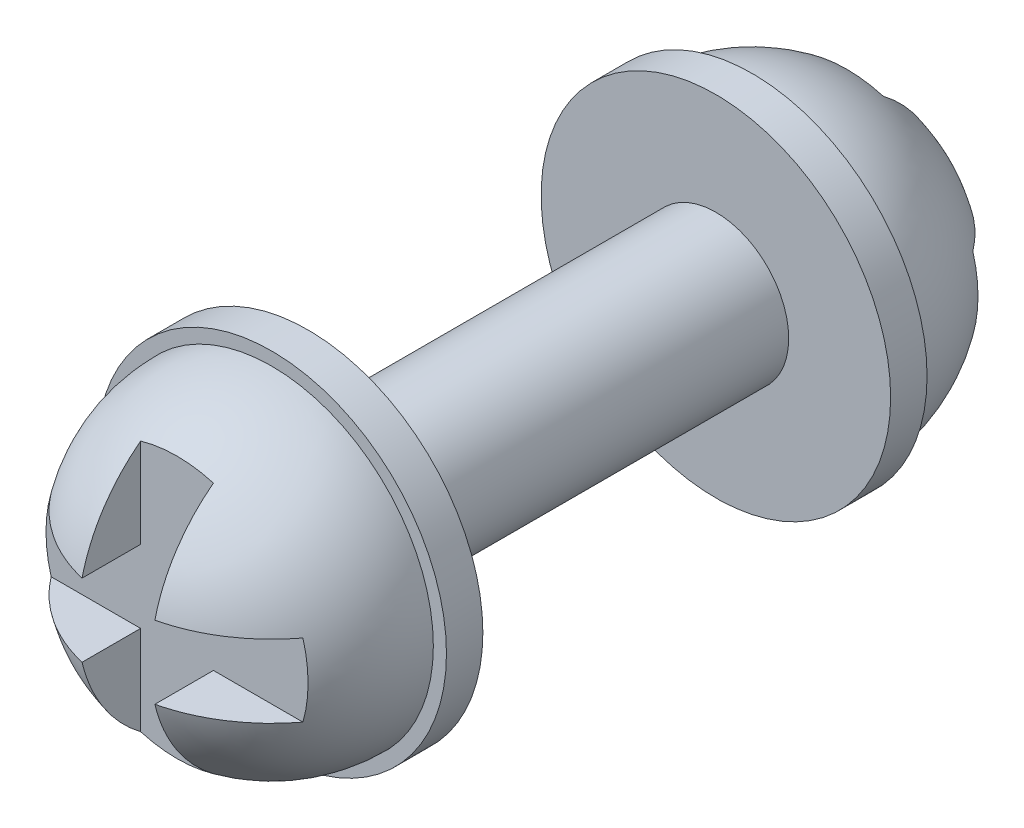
ISO-10303-21;
HEADER;
FILE_DESCRIPTION(('STEP AP214'),'2;1');
FILE_NAME('part.step','',(''),(''),'','','');
FILE_SCHEMA(('AUTOMOTIVE_DESIGN { 1 0 10303 214 1 1 1 1 }'));
ENDSEC;
DATA;
#1=APPLICATION_CONTEXT('core data for automotive mechanical design processes');
#2=APPLICATION_PROTOCOL_DEFINITION('international standard','automotive_design',2000,#1);
#3=PRODUCT_CONTEXT('',#1,'mechanical');
#4=PRODUCT('Part','Part','',(#3));
#5=PRODUCT_RELATED_PRODUCT_CATEGORY('part','',(#4));
#6=PRODUCT_DEFINITION_FORMATION('','',#4);
#7=PRODUCT_DEFINITION_CONTEXT('part definition',#1,'design');
#8=PRODUCT_DEFINITION('design','',#6,#7);
#9=PRODUCT_DEFINITION_SHAPE('','',#8);
#10=(LENGTH_UNIT() NAMED_UNIT(*) SI_UNIT(.MILLI.,.METRE.));
#11=(NAMED_UNIT(*) PLANE_ANGLE_UNIT() SI_UNIT($,.RADIAN.));
#12=(NAMED_UNIT(*) SI_UNIT($,.STERADIAN.) SOLID_ANGLE_UNIT());
#13=UNCERTAINTY_MEASURE_WITH_UNIT(LENGTH_MEASURE(1.E-05),#10,'distance_accuracy_value','');
#14=(GEOMETRIC_REPRESENTATION_CONTEXT(3) GLOBAL_UNCERTAINTY_ASSIGNED_CONTEXT((#13)) GLOBAL_UNIT_ASSIGNED_CONTEXT((#10,
#11,#12)) REPRESENTATION_CONTEXT('',''));
#15=CARTESIAN_POINT('',(0.,0.,0.));
#16=DIRECTION('',(0.,0.,1.));
#17=DIRECTION('',(1.,0.,0.));
#18=AXIS2_PLACEMENT_3D('',#15,#16,#17);
#19=CARTESIAN_POINT('',(-7.61999999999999,1.58749999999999,-20.955));
#20=DIRECTION('',(0.,1.,0.));
#21=DIRECTION('',(0.,0.,1.));
#22=AXIS2_PLACEMENT_3D('',#19,#20,#21);
#23=PLANE('',#22);
#24=CARTESIAN_POINT('',(0.,1.5874999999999,-10.4775));
#25=DIRECTION('',(0.,1.,0.));
#26=DIRECTION('',(0.,0.,1.));
#27=AXIS2_PLACEMENT_3D('',#24,#25,#26);
#28=CIRCLE('',#27,6.86740096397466);
#29=CARTESIAN_POINT('',(-1.5875,1.58749999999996,-17.1588950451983));
#30=VERTEX_POINT('',#29);
#31=CARTESIAN_POINT('',(-5.4886191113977,1.58749999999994,-14.605));
#32=VERTEX_POINT('',#31);
#33=EDGE_CURVE('E264',#30,#32,#28,.T.);
#34=ORIENTED_EDGE('',*,*,#33,.F.);
#35=DIRECTION('',(0.,0.,1.));
#36=VECTOR('',#35,1.);
#37=CARTESIAN_POINT('',(-1.58749999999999,1.58749999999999,-20.955));
#38=LINE('',#37,#36);
#39=CARTESIAN_POINT('',(-1.5875,1.58749999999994,-14.605));
#40=VERTEX_POINT('',#39);
#41=EDGE_CURVE('E177',#30,#40,#38,.T.);
#42=ORIENTED_EDGE('',*,*,#41,.T.);
#43=DIRECTION('',(1.,0.,0.));
#44=VECTOR('',#43,1.);
#45=CARTESIAN_POINT('',(-7.61999999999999,1.58749999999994,-14.605));
#46=LINE('',#45,#44);
#47=EDGE_CURVE('E210',#32,#40,#46,.T.);
#48=ORIENTED_EDGE('',*,*,#47,.F.);
#49=EDGE_LOOP('',(#34,#42,#48));
#50=FACE_BOUND('',#49,.T.);
#51=ADVANCED_FACE('F35',(#50),#23,.F.);
#52=CARTESIAN_POINT('',(-7.61999999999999,-1.58749999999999,-20.955));
#53=DIRECTION('',(0.,-1.,0.));
#54=DIRECTION('',(0.,0.,-1.));
#55=AXIS2_PLACEMENT_3D('',#52,#53,#54);
#56=PLANE('',#55);
#57=DIRECTION('',(1.,0.,0.));
#58=VECTOR('',#57,1.);
#59=CARTESIAN_POINT('',(-7.61999999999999,-1.58749999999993,-14.605));
#60=LINE('',#59,#58);
#61=CARTESIAN_POINT('',(-5.4886191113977,-1.58749999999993,-14.605));
#62=VERTEX_POINT('',#61);
#63=CARTESIAN_POINT('',(-1.5875,-1.58749999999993,-14.605));
#64=VERTEX_POINT('',#63);
#65=EDGE_CURVE('E206',#62,#64,#60,.T.);
#66=ORIENTED_EDGE('',*,*,#65,.T.);
#67=DIRECTION('',(0.,0.,-1.));
#68=VECTOR('',#67,1.);
#69=CARTESIAN_POINT('',(-1.58749999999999,-1.58749999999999,-20.955));
#70=LINE('',#69,#68);
#71=CARTESIAN_POINT('',(-1.5875,-1.58749999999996,-17.1588950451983));
#72=VERTEX_POINT('',#71);
#73=EDGE_CURVE('E279',#64,#72,#70,.T.);
#74=ORIENTED_EDGE('',*,*,#73,.T.);
#75=CARTESIAN_POINT('',(0.,-1.5874999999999,-10.4775));
#76=DIRECTION('',(0.,-1.,0.));
#77=DIRECTION('',(0.,0.,-1.));
#78=AXIS2_PLACEMENT_3D('',#75,#76,#77);
#79=CIRCLE('',#78,6.86740096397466);
#80=EDGE_CURVE('E262',#62,#72,#79,.T.);
#81=ORIENTED_EDGE('',*,*,#80,.F.);
#82=EDGE_LOOP('',(#66,#74,#81));
#83=FACE_BOUND('',#82,.T.);
#84=ADVANCED_FACE('F342',(#83),#56,.F.);
#85=CARTESIAN_POINT('',(-7.61999999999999,1.58749999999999,20.955));
#86=DIRECTION('',(0.,1.,0.));
#87=DIRECTION('',(0.,0.,1.));
#88=AXIS2_PLACEMENT_3D('',#85,#86,#87);
#89=PLANE('',#88);
#90=DIRECTION('',(1.,0.,0.));
#91=VECTOR('',#90,1.);
#92=CARTESIAN_POINT('',(-7.61999999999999,1.58749999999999,14.605));
#93=LINE('',#92,#91);
#94=CARTESIAN_POINT('',(-5.48861911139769,1.58749999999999,14.605));
#95=VERTEX_POINT('',#94);
#96=CARTESIAN_POINT('',(-1.58749999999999,1.58749999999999,14.605));
#97=VERTEX_POINT('',#96);
#98=EDGE_CURVE('E214',#95,#97,#93,.T.);
#99=ORIENTED_EDGE('',*,*,#98,.T.);
#100=DIRECTION('',(0.,0.,1.));
#101=VECTOR('',#100,1.);
#102=CARTESIAN_POINT('',(-1.58749999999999,1.58749999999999,20.955));
#103=LINE('',#102,#101);
#104=CARTESIAN_POINT('',(-1.58749999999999,1.58749999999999,17.1588950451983));
#105=VERTEX_POINT('',#104);
#106=EDGE_CURVE('E202',#97,#105,#103,.T.);
#107=ORIENTED_EDGE('',*,*,#106,.T.);
#108=CARTESIAN_POINT('',(0.,1.58749999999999,10.4775));
#109=DIRECTION('',(0.,1.,0.));
#110=DIRECTION('',(0.,0.,1.));
#111=AXIS2_PLACEMENT_3D('',#108,#109,#110);
#112=CIRCLE('',#111,6.86740096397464);
#113=EDGE_CURVE('E253',#95,#105,#112,.T.);
#114=ORIENTED_EDGE('',*,*,#113,.F.);
#115=EDGE_LOOP('',(#99,#107,#114));
#116=FACE_BOUND('',#115,.T.);
#117=ADVANCED_FACE('F304',(#116),#89,.F.);
#118=CARTESIAN_POINT('',(-7.61999999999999,-1.58750000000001,20.955));
#119=DIRECTION('',(0.,-1.,0.));
#120=DIRECTION('',(0.,0.,-1.));
#121=AXIS2_PLACEMENT_3D('',#118,#119,#120);
#122=PLANE('',#121);
#123=CARTESIAN_POINT('',(0.,-1.58749999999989,10.4775));
#124=DIRECTION('',(0.,-1.,0.));
#125=DIRECTION('',(0.,0.,-1.));
#126=AXIS2_PLACEMENT_3D('',#123,#124,#125);
#127=CIRCLE('',#126,6.86740096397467);
#128=CARTESIAN_POINT('',(-1.58749999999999,-1.58749999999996,17.1588950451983));
#129=VERTEX_POINT('',#128);
#130=CARTESIAN_POINT('',(-5.48861911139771,-1.58749999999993,14.605));
#131=VERTEX_POINT('',#130);
#132=EDGE_CURVE('E245',#129,#131,#127,.T.);
#133=ORIENTED_EDGE('',*,*,#132,.F.);
#134=DIRECTION('',(0.,0.,-1.));
#135=VECTOR('',#134,1.);
#136=CARTESIAN_POINT('',(-1.58749999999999,-1.58750000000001,20.955));
#137=LINE('',#136,#135);
#138=CARTESIAN_POINT('',(-1.58749999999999,-1.58749999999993,14.605));
#139=VERTEX_POINT('',#138);
#140=EDGE_CURVE('E11',#129,#139,#137,.T.);
#141=ORIENTED_EDGE('',*,*,#140,.T.);
#142=DIRECTION('',(1.,0.,0.));
#143=VECTOR('',#142,1.);
#144=CARTESIAN_POINT('',(-7.61999999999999,-1.58749999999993,14.605));
#145=LINE('',#144,#143);
#146=EDGE_CURVE('E219',#131,#139,#145,.T.);
#147=ORIENTED_EDGE('',*,*,#146,.F.);
#148=EDGE_LOOP('',(#133,#141,#147));
#149=FACE_BOUND('',#148,.T.);
#150=ADVANCED_FACE('F313',(#149),#122,.F.);
#151=CARTESIAN_POINT('',(0.,7.04849999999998,-10.4775));
#152=DIRECTION('',(0.,0.,1.));
#153=DIRECTION('',(1.,0.,0.));
#154=AXIS2_PLACEMENT_3D('',#151,#152,#153);
#155=PLANE('',#154);
#156=CARTESIAN_POINT('',(0.,0.,-10.4775));
#157=DIRECTION('',(0.,0.,1.));
#158=DIRECTION('',(1.,0.,0.));
#159=AXIS2_PLACEMENT_3D('',#156,#157,#158);
#160=CIRCLE('',#159,7.61999999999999);
#161=CARTESIAN_POINT('',(7.61999999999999,0.,-10.4775));
#162=VERTEX_POINT('',#161);
#163=EDGE_CURVE('E242',#162,#162,#160,.T.);
#164=ORIENTED_EDGE('',*,*,#163,.F.);
#165=EDGE_LOOP('',(#164));
#166=FACE_BOUND('',#165,.T.);
#167=CARTESIAN_POINT('',(0.,0.,-10.4775));
#168=DIRECTION('',(0.,0.,1.));
#169=DIRECTION('',(1.,0.,0.));
#170=AXIS2_PLACEMENT_3D('',#167,#168,#169);
#171=CIRCLE('',#170,7.04849999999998);
#172=CARTESIAN_POINT('',(7.04849999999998,0.,-10.4775));
#173=VERTEX_POINT('',#172);
#174=EDGE_CURVE('E217',#173,#173,#171,.T.);
#175=ORIENTED_EDGE('',*,*,#174,.T.);
#176=EDGE_LOOP('',(#175));
#177=FACE_BOUND('',#176,.T.);
#178=ADVANCED_FACE('F37',(#166,#177),#155,.F.);
#179=CARTESIAN_POINT('',(0.,0.,77.1786132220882));
#180=DIRECTION('',(0.,0.,1.));
#181=DIRECTION('',(1.,0.,0.));
#182=AXIS2_PLACEMENT_3D('',#179,#180,#181);
#183=CYLINDRICAL_SURFACE('',#182,7.61999999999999);
#184=CARTESIAN_POINT('',(0.,0.,-8.89));
#185=DIRECTION('',(0.,0.,1.));
#186=DIRECTION('',(1.,0.,0.));
#187=AXIS2_PLACEMENT_3D('',#184,#185,#186);
#188=CIRCLE('',#187,7.61999999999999);
#189=CARTESIAN_POINT('',(7.61999999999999,0.,-8.89));
#190=VERTEX_POINT('',#189);
#191=EDGE_CURVE('E239',#190,#190,#188,.T.);
#192=ORIENTED_EDGE('',*,*,#191,.F.);
#193=EDGE_LOOP('',(#192));
#194=FACE_BOUND('',#193,.T.);
#195=ORIENTED_EDGE('',*,*,#163,.T.);
#196=EDGE_LOOP('',(#195));
#197=FACE_BOUND('',#196,.T.);
#198=ADVANCED_FACE('F368',(#194,#197),#183,.T.);
#199=CARTESIAN_POINT('',(0.,3.175,-8.89));
#200=DIRECTION('',(0.,0.,-1.));
#201=DIRECTION('',(-1.,0.,0.));
#202=AXIS2_PLACEMENT_3D('',#199,#200,#201);
#203=PLANE('',#202);
#204=CARTESIAN_POINT('',(0.,0.,-8.89));
#205=DIRECTION('',(0.,0.,1.));
#206=DIRECTION('',(1.,0.,0.));
#207=AXIS2_PLACEMENT_3D('',#204,#205,#206);
#208=CIRCLE('',#207,3.175);
#209=CARTESIAN_POINT('',(3.175,0.,-8.89));
#210=VERTEX_POINT('',#209);
#211=EDGE_CURVE('E236',#210,#210,#208,.T.);
#212=ORIENTED_EDGE('',*,*,#211,.F.);
#213=EDGE_LOOP('',(#212));
#214=FACE_BOUND('',#213,.T.);
#215=ORIENTED_EDGE('',*,*,#191,.T.);
#216=EDGE_LOOP('',(#215));
#217=FACE_BOUND('',#216,.T.);
#218=ADVANCED_FACE('F396',(#214,#217),#203,.F.);
#219=CARTESIAN_POINT('',(0.,0.,77.1786132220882));
#220=DIRECTION('',(0.,0.,1.));
#221=DIRECTION('',(1.,0.,0.));
#222=AXIS2_PLACEMENT_3D('',#219,#220,#221);
#223=CYLINDRICAL_SURFACE('',#222,3.175);
#224=CARTESIAN_POINT('',(0.,0.,8.89));
#225=DIRECTION('',(0.,0.,1.));
#226=DIRECTION('',(1.,0.,0.));
#227=AXIS2_PLACEMENT_3D('',#224,#225,#226);
#228=CIRCLE('',#227,3.175);
#229=CARTESIAN_POINT('',(3.175,0.,8.89));
#230=VERTEX_POINT('',#229);
#231=EDGE_CURVE('E233',#230,#230,#228,.T.);
#232=ORIENTED_EDGE('',*,*,#231,.F.);
#233=EDGE_LOOP('',(#232));
#234=FACE_BOUND('',#233,.T.);
#235=ORIENTED_EDGE('',*,*,#211,.T.);
#236=EDGE_LOOP('',(#235));
#237=FACE_BOUND('',#236,.T.);
#238=ADVANCED_FACE('F392',(#234,#237),#223,.T.);
#239=CARTESIAN_POINT('',(0.,3.175,8.89));
#240=DIRECTION('',(0.,0.,1.));
#241=DIRECTION('',(1.,0.,0.));
#242=AXIS2_PLACEMENT_3D('',#239,#240,#241);
#243=PLANE('',#242);
#244=CARTESIAN_POINT('',(0.,0.,8.89));
#245=DIRECTION('',(0.,0.,1.));
#246=DIRECTION('',(1.,0.,0.));
#247=AXIS2_PLACEMENT_3D('',#244,#245,#246);
#248=CIRCLE('',#247,7.61999999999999);
#249=CARTESIAN_POINT('',(7.61999999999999,0.,8.89));
#250=VERTEX_POINT('',#249);
#251=EDGE_CURVE('E230',#250,#250,#248,.T.);
#252=ORIENTED_EDGE('',*,*,#251,.F.);
#253=EDGE_LOOP('',(#252));
#254=FACE_BOUND('',#253,.T.);
#255=ORIENTED_EDGE('',*,*,#231,.T.);
#256=EDGE_LOOP('',(#255));
#257=FACE_BOUND('',#256,.T.);
#258=ADVANCED_FACE('F388',(#254,#257),#243,.F.);
#259=CARTESIAN_POINT('',(0.,0.,77.1786132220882));
#260=DIRECTION('',(0.,0.,1.));
#261=DIRECTION('',(1.,0.,0.));
#262=AXIS2_PLACEMENT_3D('',#259,#260,#261);
#263=CYLINDRICAL_SURFACE('',#262,7.61999999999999);
#264=CARTESIAN_POINT('',(0.,0.,10.4775));
#265=DIRECTION('',(0.,0.,1.));
#266=DIRECTION('',(1.,0.,0.));
#267=AXIS2_PLACEMENT_3D('',#264,#265,#266);
#268=CIRCLE('',#267,7.61999999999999);
#269=CARTESIAN_POINT('',(7.61999999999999,0.,10.4775));
#270=VERTEX_POINT('',#269);
#271=EDGE_CURVE('E227',#270,#270,#268,.T.);
#272=ORIENTED_EDGE('',*,*,#271,.F.);
#273=EDGE_LOOP('',(#272));
#274=FACE_BOUND('',#273,.T.);
#275=ORIENTED_EDGE('',*,*,#251,.T.);
#276=EDGE_LOOP('',(#275));
#277=FACE_BOUND('',#276,.T.);
#278=ADVANCED_FACE('F384',(#274,#277),#263,.T.);
#279=CARTESIAN_POINT('',(0.,7.04849999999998,10.4775));
#280=DIRECTION('',(0.,0.,-1.));
#281=DIRECTION('',(-1.,0.,0.));
#282=AXIS2_PLACEMENT_3D('',#279,#280,#281);
#283=PLANE('',#282);
#284=CARTESIAN_POINT('',(0.,0.,10.4775));
#285=DIRECTION('',(0.,0.,1.));
#286=DIRECTION('',(1.,0.,0.));
#287=AXIS2_PLACEMENT_3D('',#284,#285,#286);
#288=CIRCLE('',#287,7.04849999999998);
#289=CARTESIAN_POINT('',(7.04849999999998,0.,10.4775));
#290=VERTEX_POINT('',#289);
#291=EDGE_CURVE('E224',#290,#290,#288,.T.);
#292=ORIENTED_EDGE('',*,*,#291,.F.);
#293=EDGE_LOOP('',(#292));
#294=FACE_BOUND('',#293,.T.);
#295=ORIENTED_EDGE('',*,*,#271,.T.);
#296=EDGE_LOOP('',(#295));
#297=FACE_BOUND('',#296,.T.);
#298=ADVANCED_FACE('F379',(#294,#297),#283,.F.);
#299=CARTESIAN_POINT('',(0.,0.,10.4775));
#300=DIRECTION('',(0.,0.,1.));
#301=DIRECTION('',(0.,1.,0.));
#302=AXIS2_PLACEMENT_3D('',#299,#300,#301);
#303=SPHERICAL_SURFACE('',#302,7.04849999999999);
#304=ORIENTED_EDGE('',*,*,#113,.T.);
#305=CARTESIAN_POINT('',(-1.58749999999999,0.,10.4775));
#306=DIRECTION('',(-1.,0.,0.));
#307=DIRECTION('',(0.,0.,1.));
#308=AXIS2_PLACEMENT_3D('',#305,#306,#307);
#309=CIRCLE('',#308,6.86740096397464);
#310=CARTESIAN_POINT('',(-1.58749999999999,5.4886191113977,14.605));
#311=VERTEX_POINT('',#310);
#312=EDGE_CURVE('E203',#105,#311,#309,.T.);
#313=ORIENTED_EDGE('',*,*,#312,.T.);
#314=CARTESIAN_POINT('',(0.,0.,14.605));
#315=DIRECTION('',(0.,0.,-1.));
#316=DIRECTION('',(-1.,0.,0.));
#317=AXIS2_PLACEMENT_3D('',#314,#315,#316);
#318=CIRCLE('',#317,5.71358871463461);
#319=CARTESIAN_POINT('',(1.58750000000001,5.48861911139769,14.605));
#320=VERTEX_POINT('',#319);
#321=EDGE_CURVE('E198',#311,#320,#318,.T.);
#322=ORIENTED_EDGE('',*,*,#321,.T.);
#323=CARTESIAN_POINT('',(1.58750000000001,0.,10.4775));
#324=DIRECTION('',(1.,0.,0.));
#325=DIRECTION('',(0.,0.,-1.));
#326=AXIS2_PLACEMENT_3D('',#323,#324,#325);
#327=CIRCLE('',#326,6.86740096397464);
#328=CARTESIAN_POINT('',(1.58750000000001,1.58749999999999,17.1588950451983));
#329=VERTEX_POINT('',#328);
#330=EDGE_CURVE('E192',#320,#329,#327,.T.);
#331=ORIENTED_EDGE('',*,*,#330,.T.);
#332=CARTESIAN_POINT('',(5.48861911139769,1.58749999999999,14.605));
#333=VERTEX_POINT('',#332);
#334=EDGE_CURVE('E257',#329,#333,#112,.T.);
#335=ORIENTED_EDGE('',*,*,#334,.T.);
#336=CARTESIAN_POINT('',(0.,0.,14.605));
#337=DIRECTION('',(0.,0.,-1.));
#338=DIRECTION('',(-1.,0.,0.));
#339=AXIS2_PLACEMENT_3D('',#336,#337,#338);
#340=CIRCLE('',#339,5.71358871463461);
#341=CARTESIAN_POINT('',(5.48861911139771,-1.58749999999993,14.605));
#342=VERTEX_POINT('',#341);
#343=EDGE_CURVE('E252',#333,#342,#340,.T.);
#344=ORIENTED_EDGE('',*,*,#343,.T.);
#345=CARTESIAN_POINT('',(1.58750000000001,-1.58749999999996,17.1588950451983));
#346=VERTEX_POINT('',#345);
#347=EDGE_CURVE('E246',#342,#346,#127,.T.);
#348=ORIENTED_EDGE('',*,*,#347,.T.);
#349=CARTESIAN_POINT('',(1.58750000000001,-5.48861911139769,14.605));
#350=VERTEX_POINT('',#349);
#351=EDGE_CURVE('E188',#346,#350,#327,.T.);
#352=ORIENTED_EDGE('',*,*,#351,.T.);
#353=CARTESIAN_POINT('',(-1.58749999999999,-5.4886191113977,14.605));
#354=VERTEX_POINT('',#353);
#355=EDGE_CURVE('E195',#350,#354,#318,.T.);
#356=ORIENTED_EDGE('',*,*,#355,.T.);
#357=EDGE_CURVE('E199',#354,#129,#309,.T.);
#358=ORIENTED_EDGE('',*,*,#357,.T.);
#359=ORIENTED_EDGE('',*,*,#132,.T.);
#360=EDGE_CURVE('E249',#131,#95,#340,.T.);
#361=ORIENTED_EDGE('',*,*,#360,.T.);
#362=EDGE_LOOP('',(#304,#313,#322,#331,#335,#344,#348,#352,#356,#358,#359,#361));
#363=FACE_BOUND('',#362,.T.);
#364=ORIENTED_EDGE('',*,*,#291,.T.);
#365=EDGE_LOOP('',(#364));
#366=FACE_BOUND('',#365,.T.);
#367=ADVANCED_FACE('F297',(#363,#366),#303,.T.);
#368=CARTESIAN_POINT('',(0.,0.,-10.4775));
#369=DIRECTION('',(0.,0.,1.));
#370=DIRECTION('',(0.,-1.,0.));
#371=AXIS2_PLACEMENT_3D('',#368,#369,#370);
#372=SPHERICAL_SURFACE('',#371,7.04849999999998);
#373=CARTESIAN_POINT('',(0.,0.,-14.605));
#374=DIRECTION('',(0.,0.,1.));
#375=DIRECTION('',(1.,0.,0.));
#376=AXIS2_PLACEMENT_3D('',#373,#374,#375);
#377=CIRCLE('',#376,5.7135887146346);
#378=CARTESIAN_POINT('',(1.58750000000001,5.48861911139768,-14.605));
#379=VERTEX_POINT('',#378);
#380=CARTESIAN_POINT('',(-1.5875,5.48861911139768,-14.605));
#381=VERTEX_POINT('',#380);
#382=EDGE_CURVE('E172',#379,#381,#377,.T.);
#383=ORIENTED_EDGE('',*,*,#382,.T.);
#384=CARTESIAN_POINT('',(-1.5875,0.,-10.4775));
#385=DIRECTION('',(-1.,0.,0.));
#386=DIRECTION('',(0.,0.,1.));
#387=AXIS2_PLACEMENT_3D('',#384,#385,#386);
#388=CIRCLE('',#387,6.86740096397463);
#389=EDGE_CURVE('E173',#381,#30,#388,.T.);
#390=ORIENTED_EDGE('',*,*,#389,.T.);
#391=ORIENTED_EDGE('',*,*,#33,.T.);
#392=CARTESIAN_POINT('',(0.,0.,-14.605));
#393=DIRECTION('',(0.,0.,1.));
#394=DIRECTION('',(1.,0.,0.));
#395=AXIS2_PLACEMENT_3D('',#392,#393,#394);
#396=CIRCLE('',#395,5.7135887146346);
#397=EDGE_CURVE('E261',#32,#62,#396,.T.);
#398=ORIENTED_EDGE('',*,*,#397,.T.);
#399=ORIENTED_EDGE('',*,*,#80,.T.);
#400=CARTESIAN_POINT('',(-1.5875,-5.48861911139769,-14.605));
#401=VERTEX_POINT('',#400);
#402=EDGE_CURVE('E171',#72,#401,#388,.T.);
#403=ORIENTED_EDGE('',*,*,#402,.T.);
#404=CARTESIAN_POINT('',(1.58750000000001,-5.48861911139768,-14.605));
#405=VERTEX_POINT('',#404);
#406=EDGE_CURVE('E161',#401,#405,#377,.T.);
#407=ORIENTED_EDGE('',*,*,#406,.T.);
#408=CARTESIAN_POINT('',(1.58750000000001,0.,-10.4775));
#409=DIRECTION('',(1.,0.,0.));
#410=DIRECTION('',(0.,0.,-1.));
#411=AXIS2_PLACEMENT_3D('',#408,#409,#410);
#412=CIRCLE('',#411,6.86740096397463);
#413=CARTESIAN_POINT('',(1.5875,-1.58749999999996,-17.1588950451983));
#414=VERTEX_POINT('',#413);
#415=EDGE_CURVE('E147',#405,#414,#412,.T.);
#416=ORIENTED_EDGE('',*,*,#415,.T.);
#417=CARTESIAN_POINT('',(5.4886191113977,-1.58749999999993,-14.605));
#418=VERTEX_POINT('',#417);
#419=EDGE_CURVE('E260',#414,#418,#79,.T.);
#420=ORIENTED_EDGE('',*,*,#419,.T.);
#421=CARTESIAN_POINT('',(5.4886191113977,1.58749999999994,-14.605));
#422=VERTEX_POINT('',#421);
#423=EDGE_CURVE('E256',#418,#422,#396,.T.);
#424=ORIENTED_EDGE('',*,*,#423,.T.);
#425=CARTESIAN_POINT('',(1.5875,1.58749999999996,-17.1588950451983));
#426=VERTEX_POINT('',#425);
#427=EDGE_CURVE('E265',#422,#426,#28,.T.);
#428=ORIENTED_EDGE('',*,*,#427,.T.);
#429=EDGE_CURVE('E158',#426,#379,#412,.T.);
#430=ORIENTED_EDGE('',*,*,#429,.T.);
#431=EDGE_LOOP('',(#383,#390,#391,#398,#399,#403,#407,#416,#420,#424,#428,#430));
#432=FACE_BOUND('',#431,.T.);
#433=ORIENTED_EDGE('',*,*,#174,.F.);
#434=EDGE_LOOP('',(#433));
#435=FACE_BOUND('',#434,.T.);
#436=ADVANCED_FACE('F168',(#432,#435),#372,.T.);
#437=ORIENTED_EDGE('',*,*,#334,.F.);
#438=DIRECTION('',(0.,0.,-1.));
#439=VECTOR('',#438,1.);
#440=CARTESIAN_POINT('',(1.58750000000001,1.58749999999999,20.955));
#441=LINE('',#440,#439);
#442=CARTESIAN_POINT('',(1.58750000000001,1.58749999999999,14.605));
#443=VERTEX_POINT('',#442);
#444=EDGE_CURVE('E191',#329,#443,#441,.T.);
#445=ORIENTED_EDGE('',*,*,#444,.T.);
#446=EDGE_CURVE('E218',#443,#333,#93,.T.);
#447=ORIENTED_EDGE('',*,*,#446,.T.);
#448=EDGE_LOOP('',(#437,#445,#447));
#449=FACE_BOUND('',#448,.T.);
#450=ADVANCED_FACE('F326',(#449),#89,.F.);
#451=CARTESIAN_POINT('',(-7.61999999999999,1.58749999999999,14.605));
#452=DIRECTION('',(0.,0.,-1.));
#453=DIRECTION('',(-1.,0.,0.));
#454=AXIS2_PLACEMENT_3D('',#451,#452,#453);
#455=PLANE('',#454);
#456=ORIENTED_EDGE('',*,*,#446,.F.);
#457=DIRECTION('',(0.,1.,0.));
#458=VECTOR('',#457,1.);
#459=CARTESIAN_POINT('',(1.58750000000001,-7.61999999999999,14.605));
#460=LINE('',#459,#458);
#461=EDGE_CURVE('E175',#443,#320,#460,.T.);
#462=ORIENTED_EDGE('',*,*,#461,.T.);
#463=ORIENTED_EDGE('',*,*,#321,.F.);
#464=DIRECTION('',(0.,1.,0.));
#465=VECTOR('',#464,1.);
#466=CARTESIAN_POINT('',(-1.58749999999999,-7.61999999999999,14.605));
#467=LINE('',#466,#465);
#468=EDGE_CURVE('E181',#97,#311,#467,.T.);
#469=ORIENTED_EDGE('',*,*,#468,.F.);
#470=ORIENTED_EDGE('',*,*,#98,.F.);
#471=ORIENTED_EDGE('',*,*,#360,.F.);
#472=ORIENTED_EDGE('',*,*,#146,.T.);
#473=EDGE_CURVE('E184',#354,#139,#467,.T.);
#474=ORIENTED_EDGE('',*,*,#473,.F.);
#475=ORIENTED_EDGE('',*,*,#355,.F.);
#476=CARTESIAN_POINT('',(1.58750000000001,-1.58749999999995,14.605));
#477=VERTEX_POINT('',#476);
#478=EDGE_CURVE('E185',#350,#477,#460,.T.);
#479=ORIENTED_EDGE('',*,*,#478,.T.);
#480=EDGE_CURVE('E209',#477,#342,#145,.T.);
#481=ORIENTED_EDGE('',*,*,#480,.T.);
#482=ORIENTED_EDGE('',*,*,#343,.F.);
#483=EDGE_LOOP('',(#456,#462,#463,#469,#470,#471,#472,#474,#475,#479,#481,#482));
#484=FACE_BOUND('',#483,.T.);
#485=ADVANCED_FACE('F309',(#484),#455,.F.);
#486=ORIENTED_EDGE('',*,*,#480,.F.);
#487=DIRECTION('',(0.,0.,1.));
#488=VECTOR('',#487,1.);
#489=CARTESIAN_POINT('',(1.58750000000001,-1.58750000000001,20.955));
#490=LINE('',#489,#488);
#491=EDGE_CURVE('E43',#477,#346,#490,.T.);
#492=ORIENTED_EDGE('',*,*,#491,.T.);
#493=ORIENTED_EDGE('',*,*,#347,.F.);
#494=EDGE_LOOP('',(#486,#492,#493));
#495=FACE_BOUND('',#494,.T.);
#496=ADVANCED_FACE('F322',(#495),#122,.F.);
#497=CARTESIAN_POINT('',(1.58750000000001,1.58749999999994,-14.605));
#498=VERTEX_POINT('',#497);
#499=EDGE_CURVE('E213',#498,#422,#46,.T.);
#500=ORIENTED_EDGE('',*,*,#499,.F.);
#501=DIRECTION('',(0.,0.,-1.));
#502=VECTOR('',#501,1.);
#503=CARTESIAN_POINT('',(1.5875,1.58749999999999,-20.955));
#504=LINE('',#503,#502);
#505=EDGE_CURVE('E156',#498,#426,#504,.T.);
#506=ORIENTED_EDGE('',*,*,#505,.T.);
#507=ORIENTED_EDGE('',*,*,#427,.F.);
#508=EDGE_LOOP('',(#500,#506,#507));
#509=FACE_BOUND('',#508,.T.);
#510=ADVANCED_FACE('F293',(#509),#23,.F.);
#511=ORIENTED_EDGE('',*,*,#419,.F.);
#512=DIRECTION('',(0.,0.,1.));
#513=VECTOR('',#512,1.);
#514=CARTESIAN_POINT('',(1.5875,-1.58749999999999,-20.955));
#515=LINE('',#514,#513);
#516=CARTESIAN_POINT('',(1.58750000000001,-1.58749999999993,-14.605));
#517=VERTEX_POINT('',#516);
#518=EDGE_CURVE('E152',#414,#517,#515,.T.);
#519=ORIENTED_EDGE('',*,*,#518,.T.);
#520=EDGE_CURVE('E164',#517,#418,#60,.T.);
#521=ORIENTED_EDGE('',*,*,#520,.T.);
#522=EDGE_LOOP('',(#511,#519,#521));
#523=FACE_BOUND('',#522,.T.);
#524=ADVANCED_FACE('F348',(#523),#56,.F.);
#525=CARTESIAN_POINT('',(-7.61999999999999,1.58749999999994,-14.605));
#526=DIRECTION('',(0.,0.,1.));
#527=DIRECTION('',(1.,0.,0.));
#528=AXIS2_PLACEMENT_3D('',#525,#526,#527);
#529=PLANE('',#528);
#530=ORIENTED_EDGE('',*,*,#520,.F.);
#531=DIRECTION('',(0.,1.,0.));
#532=VECTOR('',#531,1.);
#533=CARTESIAN_POINT('',(1.58750000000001,-7.61999999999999,-14.605));
#534=LINE('',#533,#532);
#535=EDGE_CURVE('E150',#405,#517,#534,.T.);
#536=ORIENTED_EDGE('',*,*,#535,.F.);
#537=ORIENTED_EDGE('',*,*,#406,.F.);
#538=DIRECTION('',(0.,1.,0.));
#539=VECTOR('',#538,1.);
#540=CARTESIAN_POINT('',(-1.5875,-7.61999999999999,-14.605));
#541=LINE('',#540,#539);
#542=EDGE_CURVE('E50',#401,#64,#541,.T.);
#543=ORIENTED_EDGE('',*,*,#542,.T.);
#544=ORIENTED_EDGE('',*,*,#65,.F.);
#545=ORIENTED_EDGE('',*,*,#397,.F.);
#546=ORIENTED_EDGE('',*,*,#47,.T.);
#547=EDGE_CURVE('E286',#40,#381,#541,.T.);
#548=ORIENTED_EDGE('',*,*,#547,.T.);
#549=ORIENTED_EDGE('',*,*,#382,.F.);
#550=EDGE_CURVE('E57',#498,#379,#534,.T.);
#551=ORIENTED_EDGE('',*,*,#550,.F.);
#552=ORIENTED_EDGE('',*,*,#499,.T.);
#553=ORIENTED_EDGE('',*,*,#423,.F.);
#554=EDGE_LOOP('',(#530,#536,#537,#543,#544,#545,#546,#548,#549,#551,#552,#553));
#555=FACE_BOUND('',#554,.T.);
#556=ADVANCED_FACE('F160',(#555),#529,.F.);
#557=CARTESIAN_POINT('',(1.58750000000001,-7.61999999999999,22.225));
#558=DIRECTION('',(1.,0.,0.));
#559=DIRECTION('',(0.,0.,-1.));
#560=AXIS2_PLACEMENT_3D('',#557,#558,#559);
#561=PLANE('',#560);
#562=ORIENTED_EDGE('',*,*,#491,.F.);
#563=ORIENTED_EDGE('',*,*,#478,.F.);
#564=ORIENTED_EDGE('',*,*,#351,.F.);
#565=EDGE_LOOP('',(#562,#563,#564));
#566=FACE_BOUND('',#565,.T.);
#567=ADVANCED_FACE('F320',(#566),#561,.F.);
#568=CARTESIAN_POINT('',(-1.58749999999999,-7.61999999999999,22.225));
#569=DIRECTION('',(-1.,0.,0.));
#570=DIRECTION('',(0.,0.,1.));
#571=AXIS2_PLACEMENT_3D('',#568,#569,#570);
#572=PLANE('',#571);
#573=ORIENTED_EDGE('',*,*,#473,.T.);
#574=ORIENTED_EDGE('',*,*,#140,.F.);
#575=ORIENTED_EDGE('',*,*,#357,.F.);
#576=EDGE_LOOP('',(#573,#574,#575));
#577=FACE_BOUND('',#576,.T.);
#578=ADVANCED_FACE('F337',(#577),#572,.F.);
#579=ORIENTED_EDGE('',*,*,#106,.F.);
#580=ORIENTED_EDGE('',*,*,#468,.T.);
#581=ORIENTED_EDGE('',*,*,#312,.F.);
#582=EDGE_LOOP('',(#579,#580,#581));
#583=FACE_BOUND('',#582,.T.);
#584=ADVANCED_FACE('F301',(#583),#572,.F.);
#585=ORIENTED_EDGE('',*,*,#461,.F.);
#586=ORIENTED_EDGE('',*,*,#444,.F.);
#587=ORIENTED_EDGE('',*,*,#330,.F.);
#588=EDGE_LOOP('',(#585,#586,#587));
#589=FACE_BOUND('',#588,.T.);
#590=ADVANCED_FACE('F328',(#589),#561,.F.);
#591=CARTESIAN_POINT('',(1.5875,-7.61999999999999,-22.225));
#592=DIRECTION('',(1.,0.,0.));
#593=DIRECTION('',(0.,0.,-1.));
#594=AXIS2_PLACEMENT_3D('',#591,#592,#593);
#595=PLANE('',#594);
#596=ORIENTED_EDGE('',*,*,#535,.T.);
#597=ORIENTED_EDGE('',*,*,#518,.F.);
#598=ORIENTED_EDGE('',*,*,#415,.F.);
#599=EDGE_LOOP('',(#596,#597,#598));
#600=FACE_BOUND('',#599,.T.);
#601=ADVANCED_FACE('F149',(#600),#595,.F.);
#602=CARTESIAN_POINT('',(-1.58749999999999,-7.61999999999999,-22.225));
#603=DIRECTION('',(-1.,0.,0.));
#604=DIRECTION('',(0.,0.,1.));
#605=AXIS2_PLACEMENT_3D('',#602,#603,#604);
#606=PLANE('',#605);
#607=ORIENTED_EDGE('',*,*,#73,.F.);
#608=ORIENTED_EDGE('',*,*,#542,.F.);
#609=ORIENTED_EDGE('',*,*,#402,.F.);
#610=EDGE_LOOP('',(#607,#608,#609));
#611=FACE_BOUND('',#610,.T.);
#612=ADVANCED_FACE('F335',(#611),#606,.F.);
#613=ORIENTED_EDGE('',*,*,#547,.F.);
#614=ORIENTED_EDGE('',*,*,#41,.F.);
#615=ORIENTED_EDGE('',*,*,#389,.F.);
#616=EDGE_LOOP('',(#613,#614,#615));
#617=FACE_BOUND('',#616,.T.);
#618=ADVANCED_FACE('F514',(#617),#606,.F.);
#619=ORIENTED_EDGE('',*,*,#505,.F.);
#620=ORIENTED_EDGE('',*,*,#550,.T.);
#621=ORIENTED_EDGE('',*,*,#429,.F.);
#622=EDGE_LOOP('',(#619,#620,#621));
#623=FACE_BOUND('',#622,.T.);
#624=ADVANCED_FACE('F289',(#623),#595,.F.);
#625=CLOSED_SHELL('',(#51,#84,#117,#150,#178,#198,#218,#238,#258,#278,#298,#367,#436,#450,#485,
#496,#510,#524,#556,#567,#578,#584,#590,#601,#612,#618,#624));
#626=MANIFOLD_SOLID_BREP('B2',#625);
#627=ADVANCED_BREP_SHAPE_REPRESENTATION('',(#18,#626),#14);
#628=SHAPE_DEFINITION_REPRESENTATION(#9,#627);
ENDSEC;
END-ISO-10303-21;
